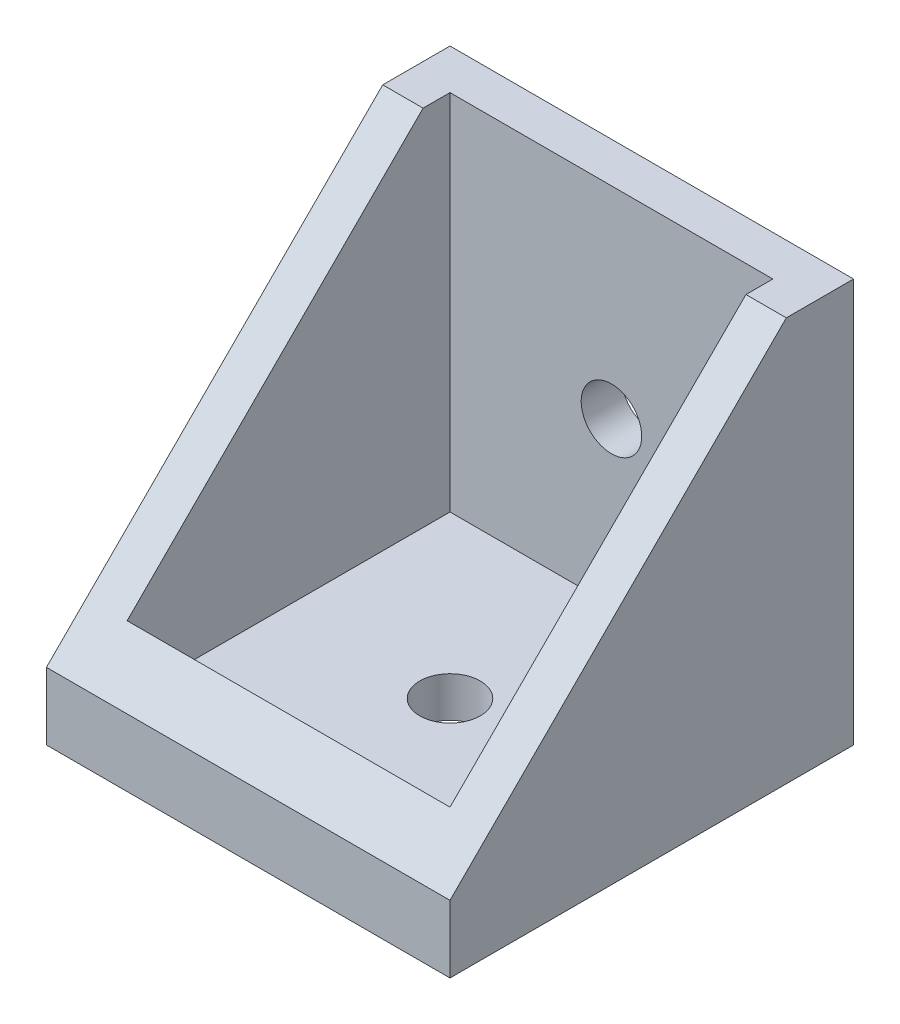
ISO-10303-21;
HEADER;
FILE_DESCRIPTION(('STEP AP214'),'2;1');
FILE_NAME('part.step','',(''),(''),'','','');
FILE_SCHEMA(('AUTOMOTIVE_DESIGN { 1 0 10303 214 1 1 1 1 }'));
ENDSEC;
DATA;
#1=APPLICATION_CONTEXT('core data for automotive mechanical design processes');
#2=APPLICATION_PROTOCOL_DEFINITION('international standard','automotive_design',2000,#1);
#3=PRODUCT_CONTEXT('',#1,'mechanical');
#4=PRODUCT('Part','Part','',(#3));
#5=PRODUCT_RELATED_PRODUCT_CATEGORY('part','',(#4));
#6=PRODUCT_DEFINITION_FORMATION('','',#4);
#7=PRODUCT_DEFINITION_CONTEXT('part definition',#1,'design');
#8=PRODUCT_DEFINITION('design','',#6,#7);
#9=PRODUCT_DEFINITION_SHAPE('','',#8);
#10=(LENGTH_UNIT() NAMED_UNIT(*) SI_UNIT(.MILLI.,.METRE.));
#11=(NAMED_UNIT(*) PLANE_ANGLE_UNIT() SI_UNIT($,.RADIAN.));
#12=(NAMED_UNIT(*) SI_UNIT($,.STERADIAN.) SOLID_ANGLE_UNIT());
#13=UNCERTAINTY_MEASURE_WITH_UNIT(LENGTH_MEASURE(1.E-05),#10,'distance_accuracy_value','');
#14=(GEOMETRIC_REPRESENTATION_CONTEXT(3) GLOBAL_UNCERTAINTY_ASSIGNED_CONTEXT((#13)) GLOBAL_UNIT_ASSIGNED_CONTEXT((#10,
#11,#12)) REPRESENTATION_CONTEXT('',''));
#15=CARTESIAN_POINT('',(0.,0.,0.));
#16=DIRECTION('',(0.,0.,1.));
#17=DIRECTION('',(1.,0.,0.));
#18=AXIS2_PLACEMENT_3D('',#15,#16,#17);
#19=CARTESIAN_POINT('',(-15.,30.,-15.));
#20=DIRECTION('',(1.,0.,0.));
#21=DIRECTION('',(0.,0.,-1.));
#22=AXIS2_PLACEMENT_3D('',#19,#20,#21);
#23=PLANE('',#22);
#24=DIRECTION('',(0.,-1.,0.));
#25=VECTOR('',#24,1.);
#26=CARTESIAN_POINT('',(-15.,30.,15.));
#27=LINE('',#26,#25);
#28=CARTESIAN_POINT('',(-15.,4.99999999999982,15.));
#29=VERTEX_POINT('',#28);
#30=CARTESIAN_POINT('',(-15.,0.,15.));
#31=VERTEX_POINT('',#30);
#32=EDGE_CURVE('E179',#29,#31,#27,.T.);
#33=ORIENTED_EDGE('',*,*,#32,.F.);
#34=DIRECTION('',(0.,0.707106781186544,-0.707106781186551));
#35=VECTOR('',#34,1.);
#36=CARTESIAN_POINT('',(-15.,30.,-10.0000000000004));
#37=LINE('',#36,#35);
#38=CARTESIAN_POINT('',(-15.,30.,-10.0000000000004));
#39=VERTEX_POINT('',#38);
#40=EDGE_CURVE('E11',#29,#39,#37,.T.);
#41=ORIENTED_EDGE('',*,*,#40,.T.);
#42=DIRECTION('',(0.,0.,1.));
#43=VECTOR('',#42,1.);
#44=CARTESIAN_POINT('',(-15.,30.,-15.));
#45=LINE('',#44,#43);
#46=CARTESIAN_POINT('',(-15.,30.,-15.));
#47=VERTEX_POINT('',#46);
#48=EDGE_CURVE('E155',#47,#39,#45,.T.);
#49=ORIENTED_EDGE('',*,*,#48,.F.);
#50=DIRECTION('',(0.,-1.,0.));
#51=VECTOR('',#50,1.);
#52=CARTESIAN_POINT('',(-15.,30.,-15.));
#53=LINE('',#52,#51);
#54=CARTESIAN_POINT('',(-15.,0.,-15.));
#55=VERTEX_POINT('',#54);
#56=EDGE_CURVE('E163',#47,#55,#53,.T.);
#57=ORIENTED_EDGE('',*,*,#56,.T.);
#58=DIRECTION('',(0.,0.,1.));
#59=VECTOR('',#58,1.);
#60=CARTESIAN_POINT('',(-15.,0.,-15.));
#61=LINE('',#60,#59);
#62=EDGE_CURVE('E150',#55,#31,#61,.T.);
#63=ORIENTED_EDGE('',*,*,#62,.T.);
#64=EDGE_LOOP('',(#33,#41,#49,#57,#63));
#65=FACE_BOUND('',#64,.T.);
#66=ADVANCED_FACE('F33',(#65),#23,.F.);
#67=CARTESIAN_POINT('',(-15.,30.,15.));
#68=DIRECTION('',(0.,0.,-1.));
#69=DIRECTION('',(-1.,0.,0.));
#70=AXIS2_PLACEMENT_3D('',#67,#68,#69);
#71=PLANE('',#70);
#72=DIRECTION('',(0.,-1.,0.));
#73=VECTOR('',#72,1.);
#74=CARTESIAN_POINT('',(15.,30.,15.));
#75=LINE('',#74,#73);
#76=CARTESIAN_POINT('',(15.,4.99999999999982,15.));
#77=VERTEX_POINT('',#76);
#78=CARTESIAN_POINT('',(15.,0.,15.));
#79=VERTEX_POINT('',#78);
#80=EDGE_CURVE('E177',#77,#79,#75,.T.);
#81=ORIENTED_EDGE('',*,*,#80,.F.);
#82=DIRECTION('',(-1.,0.,0.));
#83=VECTOR('',#82,1.);
#84=CARTESIAN_POINT('',(-15.,4.99999999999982,15.));
#85=LINE('',#84,#83);
#86=EDGE_CURVE('E41',#77,#29,#85,.T.);
#87=ORIENTED_EDGE('',*,*,#86,.T.);
#88=ORIENTED_EDGE('',*,*,#32,.T.);
#89=DIRECTION('',(1.,0.,0.));
#90=VECTOR('',#89,1.);
#91=CARTESIAN_POINT('',(-15.,0.,15.));
#92=LINE('',#91,#90);
#93=EDGE_CURVE('E166',#31,#79,#92,.T.);
#94=ORIENTED_EDGE('',*,*,#93,.T.);
#95=EDGE_LOOP('',(#81,#87,#88,#94));
#96=FACE_BOUND('',#95,.T.);
#97=ADVANCED_FACE('F216',(#96),#71,.F.);
#98=CARTESIAN_POINT('',(15.,30.,-15.));
#99=DIRECTION('',(-1.,0.,0.));
#100=DIRECTION('',(0.,0.,1.));
#101=AXIS2_PLACEMENT_3D('',#98,#99,#100);
#102=PLANE('',#101);
#103=DIRECTION('',(0.,0.,-1.));
#104=VECTOR('',#103,1.);
#105=CARTESIAN_POINT('',(15.,30.,-15.));
#106=LINE('',#105,#104);
#107=CARTESIAN_POINT('',(15.,30.,-10.0000000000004));
#108=VERTEX_POINT('',#107);
#109=CARTESIAN_POINT('',(15.,30.,-15.));
#110=VERTEX_POINT('',#109);
#111=EDGE_CURVE('E158',#108,#110,#106,.T.);
#112=ORIENTED_EDGE('',*,*,#111,.F.);
#113=DIRECTION('',(0.,-0.707106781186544,0.707106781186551));
#114=VECTOR('',#113,1.);
#115=CARTESIAN_POINT('',(15.,30.,-10.0000000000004));
#116=LINE('',#115,#114);
#117=EDGE_CURVE('E55',#108,#77,#116,.T.);
#118=ORIENTED_EDGE('',*,*,#117,.T.);
#119=ORIENTED_EDGE('',*,*,#80,.T.);
#120=DIRECTION('',(0.,0.,-1.));
#121=VECTOR('',#120,1.);
#122=CARTESIAN_POINT('',(15.,0.,-15.));
#123=LINE('',#122,#121);
#124=CARTESIAN_POINT('',(15.,0.,-15.));
#125=VERTEX_POINT('',#124);
#126=EDGE_CURVE('E169',#79,#125,#123,.T.);
#127=ORIENTED_EDGE('',*,*,#126,.T.);
#128=DIRECTION('',(0.,-1.,0.));
#129=VECTOR('',#128,1.);
#130=CARTESIAN_POINT('',(15.,30.,-15.));
#131=LINE('',#130,#129);
#132=EDGE_CURVE('E174',#110,#125,#131,.T.);
#133=ORIENTED_EDGE('',*,*,#132,.F.);
#134=EDGE_LOOP('',(#112,#118,#119,#127,#133));
#135=FACE_BOUND('',#134,.T.);
#136=ADVANCED_FACE('F217',(#135),#102,.F.);
#137=CARTESIAN_POINT('',(-15.,30.,-15.));
#138=DIRECTION('',(0.,0.,1.));
#139=DIRECTION('',(1.,0.,0.));
#140=AXIS2_PLACEMENT_3D('',#137,#138,#139);
#141=PLANE('',#140);
#142=CARTESIAN_POINT('',(0.,15.,-15.));
#143=DIRECTION('',(0.,0.,1.));
#144=DIRECTION('',(1.,0.,0.));
#145=AXIS2_PLACEMENT_3D('',#142,#143,#144);
#146=CIRCLE('',#145,2.25);
#147=CARTESIAN_POINT('',(2.25,15.,-15.));
#148=VERTEX_POINT('',#147);
#149=EDGE_CURVE('E330',#148,#148,#146,.T.);
#150=ORIENTED_EDGE('',*,*,#149,.T.);
#151=EDGE_LOOP('',(#150));
#152=FACE_BOUND('',#151,.T.);
#153=DIRECTION('',(-1.,0.,0.));
#154=VECTOR('',#153,1.);
#155=CARTESIAN_POINT('',(-15.,0.,-15.));
#156=LINE('',#155,#154);
#157=EDGE_CURVE('E159',#125,#55,#156,.T.);
#158=ORIENTED_EDGE('',*,*,#157,.T.);
#159=ORIENTED_EDGE('',*,*,#56,.F.);
#160=DIRECTION('',(-1.,0.,0.));
#161=VECTOR('',#160,1.);
#162=CARTESIAN_POINT('',(-15.,30.,-15.));
#163=LINE('',#162,#161);
#164=EDGE_CURVE('E161',#110,#47,#163,.T.);
#165=ORIENTED_EDGE('',*,*,#164,.F.);
#166=ORIENTED_EDGE('',*,*,#132,.T.);
#167=EDGE_LOOP('',(#158,#159,#165,#166));
#168=FACE_BOUND('',#167,.T.);
#169=ADVANCED_FACE('F209',(#152,#168),#141,.F.);
#170=CARTESIAN_POINT('',(0.,30.,0.));
#171=DIRECTION('',(0.,1.,0.));
#172=DIRECTION('',(0.,0.,1.));
#173=AXIS2_PLACEMENT_3D('',#170,#171,#172);
#174=PLANE('',#173);
#175=ORIENTED_EDGE('',*,*,#48,.T.);
#176=DIRECTION('',(1.,0.,0.));
#177=VECTOR('',#176,1.);
#178=CARTESIAN_POINT('',(15.,30.,-10.0000000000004));
#179=LINE('',#178,#177);
#180=CARTESIAN_POINT('',(-12.,30.,-10.0000000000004));
#181=VERTEX_POINT('',#180);
#182=EDGE_CURVE('E183',#39,#181,#179,.T.);
#183=ORIENTED_EDGE('',*,*,#182,.T.);
#184=DIRECTION('',(0.,0.,1.));
#185=VECTOR('',#184,1.);
#186=CARTESIAN_POINT('',(-12.,30.,-12.));
#187=LINE('',#186,#185);
#188=CARTESIAN_POINT('',(-12.,30.,-12.));
#189=VERTEX_POINT('',#188);
#190=EDGE_CURVE('E144',#189,#181,#187,.T.);
#191=ORIENTED_EDGE('',*,*,#190,.F.);
#192=DIRECTION('',(-1.,0.,0.));
#193=VECTOR('',#192,1.);
#194=CARTESIAN_POINT('',(-12.,30.,-12.));
#195=LINE('',#194,#193);
#196=CARTESIAN_POINT('',(12.,30.,-12.));
#197=VERTEX_POINT('',#196);
#198=EDGE_CURVE('E133',#197,#189,#195,.T.);
#199=ORIENTED_EDGE('',*,*,#198,.F.);
#200=DIRECTION('',(0.,0.,-1.));
#201=VECTOR('',#200,1.);
#202=CARTESIAN_POINT('',(12.,30.,-12.));
#203=LINE('',#202,#201);
#204=CARTESIAN_POINT('',(12.,30.,-10.0000000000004));
#205=VERTEX_POINT('',#204);
#206=EDGE_CURVE('E136',#205,#197,#203,.T.);
#207=ORIENTED_EDGE('',*,*,#206,.F.);
#208=DIRECTION('',(1.,0.,0.));
#209=VECTOR('',#208,1.);
#210=CARTESIAN_POINT('',(15.,30.,-10.0000000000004));
#211=LINE('',#210,#209);
#212=EDGE_CURVE('E181',#205,#108,#211,.T.);
#213=ORIENTED_EDGE('',*,*,#212,.T.);
#214=ORIENTED_EDGE('',*,*,#111,.T.);
#215=ORIENTED_EDGE('',*,*,#164,.T.);
#216=EDGE_LOOP('',(#175,#183,#191,#199,#207,#213,#214,#215));
#217=FACE_BOUND('',#216,.T.);
#218=ADVANCED_FACE('F199',(#217),#174,.T.);
#219=CARTESIAN_POINT('',(0.,0.,0.));
#220=DIRECTION('',(0.,1.,0.));
#221=DIRECTION('',(0.,0.,1.));
#222=AXIS2_PLACEMENT_3D('',#219,#220,#221);
#223=PLANE('',#222);
#224=CARTESIAN_POINT('',(0.,0.,0.));
#225=DIRECTION('',(0.,1.,0.));
#226=DIRECTION('',(0.,0.,1.));
#227=AXIS2_PLACEMENT_3D('',#224,#225,#226);
#228=CIRCLE('',#227,2.25);
#229=CARTESIAN_POINT('',(0.,0.,2.25));
#230=VERTEX_POINT('',#229);
#231=EDGE_CURVE('E146',#230,#230,#228,.T.);
#232=ORIENTED_EDGE('',*,*,#231,.T.);
#233=EDGE_LOOP('',(#232));
#234=FACE_BOUND('',#233,.T.);
#235=ORIENTED_EDGE('',*,*,#62,.F.);
#236=ORIENTED_EDGE('',*,*,#157,.F.);
#237=ORIENTED_EDGE('',*,*,#126,.F.);
#238=ORIENTED_EDGE('',*,*,#93,.F.);
#239=EDGE_LOOP('',(#235,#236,#237,#238));
#240=FACE_BOUND('',#239,.T.);
#241=ADVANCED_FACE('F214',(#234,#240),#223,.F.);
#242=CARTESIAN_POINT('',(-12.,3.,-12.));
#243=DIRECTION('',(-1.,0.,0.));
#244=DIRECTION('',(0.,0.,1.));
#245=AXIS2_PLACEMENT_3D('',#242,#243,#244);
#246=PLANE('',#245);
#247=ORIENTED_EDGE('',*,*,#190,.T.);
#248=DIRECTION('',(0.,-0.707106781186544,0.707106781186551));
#249=VECTOR('',#248,1.);
#250=CARTESIAN_POINT('',(-12.,30.,-10.0000000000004));
#251=LINE('',#250,#249);
#252=CARTESIAN_POINT('',(-12.,7.99999999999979,12.));
#253=VERTEX_POINT('',#252);
#254=EDGE_CURVE('E116',#181,#253,#251,.T.);
#255=ORIENTED_EDGE('',*,*,#254,.T.);
#256=DIRECTION('',(0.,1.,0.));
#257=VECTOR('',#256,1.);
#258=CARTESIAN_POINT('',(-12.,3.,12.));
#259=LINE('',#258,#257);
#260=CARTESIAN_POINT('',(-12.,3.,12.));
#261=VERTEX_POINT('',#260);
#262=EDGE_CURVE('E109',#261,#253,#259,.T.);
#263=ORIENTED_EDGE('',*,*,#262,.F.);
#264=DIRECTION('',(0.,0.,1.));
#265=VECTOR('',#264,1.);
#266=CARTESIAN_POINT('',(-12.,3.,-12.));
#267=LINE('',#266,#265);
#268=CARTESIAN_POINT('',(-12.,3.,-12.));
#269=VERTEX_POINT('',#268);
#270=EDGE_CURVE('E114',#269,#261,#267,.T.);
#271=ORIENTED_EDGE('',*,*,#270,.F.);
#272=DIRECTION('',(0.,1.,0.));
#273=VECTOR('',#272,1.);
#274=CARTESIAN_POINT('',(-12.,3.,-12.));
#275=LINE('',#274,#273);
#276=EDGE_CURVE('E148',#269,#189,#275,.T.);
#277=ORIENTED_EDGE('',*,*,#276,.T.);
#278=EDGE_LOOP('',(#247,#255,#263,#271,#277));
#279=FACE_BOUND('',#278,.T.);
#280=ADVANCED_FACE('F112',(#279),#246,.F.);
#281=CARTESIAN_POINT('',(-12.,3.,-12.));
#282=DIRECTION('',(0.,0.,-1.));
#283=DIRECTION('',(-1.,0.,0.));
#284=AXIS2_PLACEMENT_3D('',#281,#282,#283);
#285=PLANE('',#284);
#286=CARTESIAN_POINT('',(0.,15.,-12.));
#287=DIRECTION('',(0.,0.,-1.));
#288=DIRECTION('',(-1.,0.,0.));
#289=AXIS2_PLACEMENT_3D('',#286,#287,#288);
#290=CIRCLE('',#289,2.25);
#291=CARTESIAN_POINT('',(-2.25,15.,-12.));
#292=VERTEX_POINT('',#291);
#293=EDGE_CURVE('E328',#292,#292,#290,.T.);
#294=ORIENTED_EDGE('',*,*,#293,.T.);
#295=EDGE_LOOP('',(#294));
#296=FACE_BOUND('',#295,.T.);
#297=ORIENTED_EDGE('',*,*,#198,.T.);
#298=ORIENTED_EDGE('',*,*,#276,.F.);
#299=DIRECTION('',(-1.,0.,0.));
#300=VECTOR('',#299,1.);
#301=CARTESIAN_POINT('',(-12.,3.,-12.));
#302=LINE('',#301,#300);
#303=CARTESIAN_POINT('',(12.,3.,-12.));
#304=VERTEX_POINT('',#303);
#305=EDGE_CURVE('E120',#304,#269,#302,.T.);
#306=ORIENTED_EDGE('',*,*,#305,.F.);
#307=DIRECTION('',(0.,1.,0.));
#308=VECTOR('',#307,1.);
#309=CARTESIAN_POINT('',(12.,3.,-12.));
#310=LINE('',#309,#308);
#311=EDGE_CURVE('E151',#304,#197,#310,.T.);
#312=ORIENTED_EDGE('',*,*,#311,.T.);
#313=EDGE_LOOP('',(#297,#298,#306,#312));
#314=FACE_BOUND('',#313,.T.);
#315=ADVANCED_FACE('F259',(#296,#314),#285,.F.);
#316=CARTESIAN_POINT('',(12.,3.,-12.));
#317=DIRECTION('',(1.,0.,0.));
#318=DIRECTION('',(0.,0.,-1.));
#319=AXIS2_PLACEMENT_3D('',#316,#317,#318);
#320=PLANE('',#319);
#321=DIRECTION('',(0.,1.,0.));
#322=VECTOR('',#321,1.);
#323=CARTESIAN_POINT('',(12.,3.,12.));
#324=LINE('',#323,#322);
#325=CARTESIAN_POINT('',(12.,3.,12.));
#326=VERTEX_POINT('',#325);
#327=CARTESIAN_POINT('',(12.,7.99999999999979,12.));
#328=VERTEX_POINT('',#327);
#329=EDGE_CURVE('E119',#326,#328,#324,.T.);
#330=ORIENTED_EDGE('',*,*,#329,.T.);
#331=DIRECTION('',(0.,0.707106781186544,-0.707106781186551));
#332=VECTOR('',#331,1.);
#333=CARTESIAN_POINT('',(12.,30.,-10.0000000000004));
#334=LINE('',#333,#332);
#335=EDGE_CURVE('E189',#328,#205,#334,.T.);
#336=ORIENTED_EDGE('',*,*,#335,.T.);
#337=ORIENTED_EDGE('',*,*,#206,.T.);
#338=ORIENTED_EDGE('',*,*,#311,.F.);
#339=DIRECTION('',(0.,0.,-1.));
#340=VECTOR('',#339,1.);
#341=CARTESIAN_POINT('',(12.,3.,-12.));
#342=LINE('',#341,#340);
#343=EDGE_CURVE('E129',#326,#304,#342,.T.);
#344=ORIENTED_EDGE('',*,*,#343,.F.);
#345=EDGE_LOOP('',(#330,#336,#337,#338,#344));
#346=FACE_BOUND('',#345,.T.);
#347=ADVANCED_FACE('F194',(#346),#320,.F.);
#348=CARTESIAN_POINT('',(-12.,3.,12.));
#349=DIRECTION('',(0.,0.,1.));
#350=DIRECTION('',(1.,0.,0.));
#351=AXIS2_PLACEMENT_3D('',#348,#349,#350);
#352=PLANE('',#351);
#353=ORIENTED_EDGE('',*,*,#262,.T.);
#354=DIRECTION('',(1.,0.,0.));
#355=VECTOR('',#354,1.);
#356=CARTESIAN_POINT('',(0.,7.99999999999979,12.));
#357=LINE('',#356,#355);
#358=EDGE_CURVE('E187',#253,#328,#357,.T.);
#359=ORIENTED_EDGE('',*,*,#358,.T.);
#360=ORIENTED_EDGE('',*,*,#329,.F.);
#361=DIRECTION('',(1.,0.,0.));
#362=VECTOR('',#361,1.);
#363=CARTESIAN_POINT('',(-12.,3.,12.));
#364=LINE('',#363,#362);
#365=EDGE_CURVE('E123',#261,#326,#364,.T.);
#366=ORIENTED_EDGE('',*,*,#365,.F.);
#367=EDGE_LOOP('',(#353,#359,#360,#366));
#368=FACE_BOUND('',#367,.T.);
#369=ADVANCED_FACE('F124',(#368),#352,.F.);
#370=CARTESIAN_POINT('',(0.,3.,0.));
#371=DIRECTION('',(0.,1.,0.));
#372=DIRECTION('',(0.,0.,1.));
#373=AXIS2_PLACEMENT_3D('',#370,#371,#372);
#374=PLANE('',#373);
#375=CARTESIAN_POINT('',(0.,3.,0.));
#376=DIRECTION('',(0.,1.,0.));
#377=DIRECTION('',(0.,0.,1.));
#378=AXIS2_PLACEMENT_3D('',#375,#376,#377);
#379=CIRCLE('',#378,2.25);
#380=CARTESIAN_POINT('',(0.,3.,2.25));
#381=VERTEX_POINT('',#380);
#382=EDGE_CURVE('E139',#381,#381,#379,.T.);
#383=ORIENTED_EDGE('',*,*,#382,.F.);
#384=EDGE_LOOP('',(#383));
#385=FACE_BOUND('',#384,.T.);
#386=ORIENTED_EDGE('',*,*,#270,.T.);
#387=ORIENTED_EDGE('',*,*,#365,.T.);
#388=ORIENTED_EDGE('',*,*,#343,.T.);
#389=ORIENTED_EDGE('',*,*,#305,.T.);
#390=EDGE_LOOP('',(#386,#387,#388,#389));
#391=FACE_BOUND('',#390,.T.);
#392=ADVANCED_FACE('F131',(#385,#391),#374,.T.);
#393=CARTESIAN_POINT('',(0.,0.,0.));
#394=DIRECTION('',(0.,1.,0.));
#395=DIRECTION('',(0.,0.,1.));
#396=AXIS2_PLACEMENT_3D('',#393,#394,#395);
#397=CYLINDRICAL_SURFACE('',#396,2.25);
#398=ORIENTED_EDGE('',*,*,#231,.F.);
#399=EDGE_LOOP('',(#398));
#400=FACE_BOUND('',#399,.T.);
#401=ORIENTED_EDGE('',*,*,#382,.T.);
#402=EDGE_LOOP('',(#401));
#403=FACE_BOUND('',#402,.T.);
#404=ADVANCED_FACE('F295',(#400,#403),#397,.F.);
#405=CARTESIAN_POINT('',(0.,15.,-15.));
#406=DIRECTION('',(0.,0.,1.));
#407=DIRECTION('',(1.,0.,0.));
#408=AXIS2_PLACEMENT_3D('',#405,#406,#407);
#409=CYLINDRICAL_SURFACE('',#408,2.25);
#410=ORIENTED_EDGE('',*,*,#149,.F.);
#411=EDGE_LOOP('',(#410));
#412=FACE_BOUND('',#411,.T.);
#413=ORIENTED_EDGE('',*,*,#293,.F.);
#414=EDGE_LOOP('',(#413));
#415=FACE_BOUND('',#414,.T.);
#416=ADVANCED_FACE('F287',(#412,#415),#409,.F.);
#417=CARTESIAN_POINT('',(0.,30.,-10.0000000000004));
#418=DIRECTION('',(0.,0.707106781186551,0.707106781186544));
#419=DIRECTION('',(-1.,0.,0.));
#420=AXIS2_PLACEMENT_3D('',#417,#418,#419);
#421=PLANE('',#420);
#422=ORIENTED_EDGE('',*,*,#40,.F.);
#423=ORIENTED_EDGE('',*,*,#86,.F.);
#424=ORIENTED_EDGE('',*,*,#117,.F.);
#425=ORIENTED_EDGE('',*,*,#212,.F.);
#426=ORIENTED_EDGE('',*,*,#335,.F.);
#427=ORIENTED_EDGE('',*,*,#358,.F.);
#428=ORIENTED_EDGE('',*,*,#254,.F.);
#429=ORIENTED_EDGE('',*,*,#182,.F.);
#430=EDGE_LOOP('',(#422,#423,#424,#425,#426,#427,#428,#429));
#431=FACE_BOUND('',#430,.T.);
#432=ADVANCED_FACE('F35',(#431),#421,.T.);
#433=CLOSED_SHELL('',(#66,#97,#136,#169,#218,#241,#280,#315,#347,#369,#392,#404,#416,#432));
#434=MANIFOLD_SOLID_BREP('B2',#433);
#435=ADVANCED_BREP_SHAPE_REPRESENTATION('',(#18,#434),#14);
#436=SHAPE_DEFINITION_REPRESENTATION(#9,#435);
ENDSEC;
END-ISO-10303-21;
